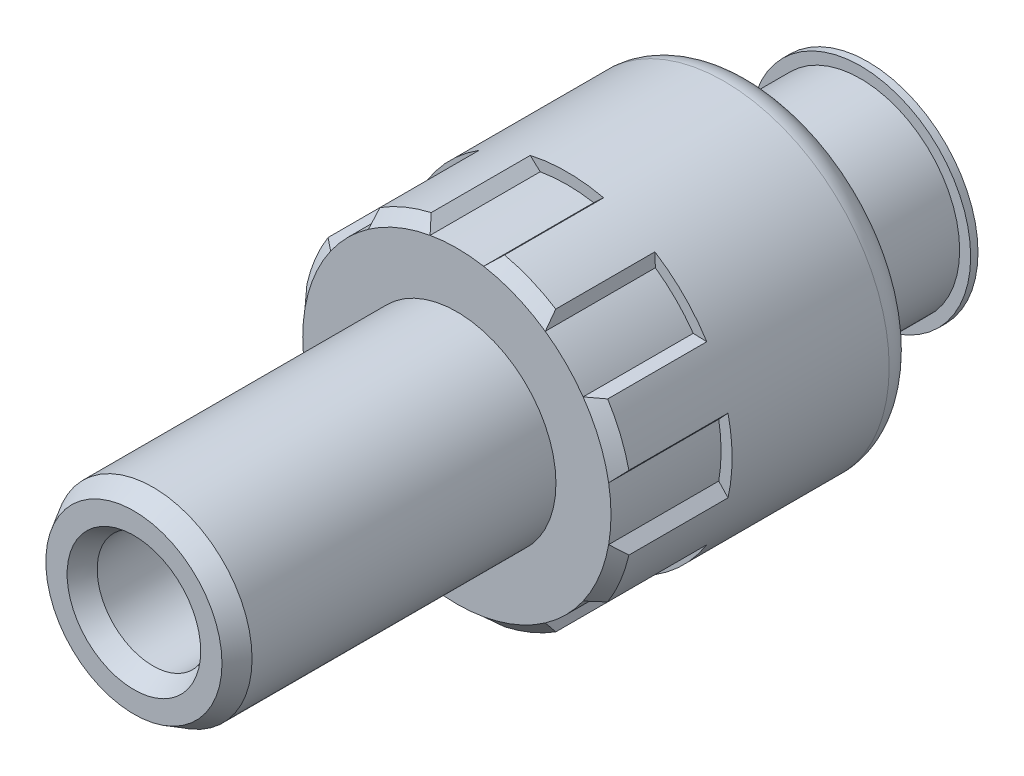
from build123d import *

# Parameters (mm, degrees)
FLUTES_START        = -3.81
FLUTES_DEPTH        = 3.81
SKETCH3_R           = 3.106695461
BOSS_EXTRUDE1_DEPTH = 7.62


with BuildPart() as part:
    # Sketch1 → body (revolve)
    with BuildSketch(Plane(origin=(0, 0, 0), x_dir=(0, 0, -1), z_dir=(1, 0, 0)), mode=Mode.PRIVATE) as body_sk:
        with BuildLine():
            Line((0, 2.3114), (0, 3.048))
            Line((0, 3.048), (0.659911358, 3.429))
            Line((0.659911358, 3.429), (11.176, 3.429))
            Line((11.176, 3.429), (11.176, 5.334))
            Line((11.176, 5.334), (11.557, 5.715))
            Line((11.557, 5.715), (20.4216, 5.715))
            ThreePointArc((20.4216, 5.715), (21.14002049, 5.41742049), (21.4376, 4.699))
            Line((21.4376, 4.699), (21.4376, 3.81))
            Line((21.4376, 3.81), (21.4376, 3.429))
            Line((21.4376, 3.429), (25.146, 3.429))
            Line((25.146, 3.429), (25.146, 3.81))
            Line((25.146, 3.81), (25.4, 3.81))
            Line((25.4, 3.81), (25.4, 3.175))
            Line((25.4, 3.175), (17.4752, 3.175))
            Line((17.4752, 3.175), (17.4752, 1.9304))
            Line((17.4752, 1.9304), (0.659911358, 1.9304))
            Line((0.659911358, 1.9304), (0, 2.3114))
        make_face()
    revolve(body_sk.sketch.rotate(Axis((0, 0, 0), (0, 0, -1)), 90), axis=Axis((0, 0, 0), (0, 0, -1)))

    # Sketch2 → flutes (cut)
    with BuildSketch(Plane.XY.offset(-11.176).offset(FLUTES_START)):
        with BuildLine():
            Line((3.059456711, 4.369357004), (3.04204577, 4.838096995))
            ThreePointArc((3.04204577, 4.838096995), (4.041115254, 4.041115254), (4.838096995, 3.04204577))
            Line((4.838096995, 3.04204577), (4.369357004, 3.059456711))
            ThreePointArc((4.369357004, 3.059456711), (3.771707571, 3.771707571), (3.059456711, 4.369357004))
        make_face()
        with BuildLine():
            Line((-0.92623938, 5.252964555), (-1.27, 5.572102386))
            ThreePointArc((-1.27, 5.572102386), (0, 5.715), (1.27, 5.572102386))
            Line((1.27, 5.572102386), (0.92623938, 5.252964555))
            ThreePointArc((0.92623938, 5.252964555), (0, 5.334), (-0.92623938, 5.252964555))
        make_face()
        with BuildLine():
            Line((5.252964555, 0.92623938), (5.572102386, 1.27))
            ThreePointArc((5.572102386, 1.27), (5.715, 0), (5.572102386, -1.27))
            Line((5.572102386, -1.27), (5.252964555, -0.92623938))
            ThreePointArc((5.252964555, -0.92623938), (5.334, 0), (5.252964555, 0.92623938))
        make_face()
        with BuildLine():
            Line((4.369357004, -3.059456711), (4.838096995, -3.04204577))
            ThreePointArc((4.838096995, -3.04204577), (4.041115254, -4.041115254), (3.04204577, -4.838096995))
            Line((3.04204577, -4.838096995), (3.059456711, -4.369357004))
            ThreePointArc((3.059456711, -4.369357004), (3.771707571, -3.771707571), (4.369357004, -3.059456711))
        make_face()
        with BuildLine():
            Line((0.92623938, -5.252964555), (1.27, -5.572102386))
            ThreePointArc((1.27, -5.572102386), (0, -5.715), (-1.27, -5.572102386))
            Line((-1.27, -5.572102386), (-0.92623938, -5.252964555))
            ThreePointArc((-0.92623938, -5.252964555), (0, -5.334), (0.92623938, -5.252964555))
        make_face()
        with BuildLine():
            Line((-3.059456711, -4.369357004), (-3.04204577, -4.838096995))
            ThreePointArc((-3.04204577, -4.838096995), (-4.041115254, -4.041115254), (-4.838096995, -3.04204577))
            Line((-4.838096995, -3.04204577), (-4.369357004, -3.059456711))
            ThreePointArc((-4.369357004, -3.059456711), (-3.771707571, -3.771707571), (-3.059456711, -4.369357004))
        make_face()
        with BuildLine():
            Line((-5.252964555, -0.92623938), (-5.572102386, -1.27))
            ThreePointArc((-5.572102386, -1.27), (-5.715, 0), (-5.572102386, 1.27))
            Line((-5.572102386, 1.27), (-5.252964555, 0.92623938))
            ThreePointArc((-5.252964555, 0.92623938), (-5.334, 0), (-5.252964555, -0.92623938))
        make_face()
        with BuildLine():
            Line((-4.369357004, 3.059456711), (-4.838096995, 3.04204577))
            ThreePointArc((-4.838096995, 3.04204577), (-4.041115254, 4.041115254), (-3.04204577, 4.838096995))
            Line((-3.04204577, 4.838096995), (-3.059456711, 4.369357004))
            ThreePointArc((-3.059456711, 4.369357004), (-3.771707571, 3.771707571), (-4.369357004, 3.059456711))
        make_face()
    extrude(amount=FLUTES_DEPTH, mode=Mode.SUBTRACT)

    # Sketch3 → Boss-Extrude1 (add)
    with BuildSketch(Plane(origin=(0, 0, -17.4752), x_dir=(-1, 0, 0), z_dir=(0, 0, -1))):
        with Locations(Location((0, 0, 0), (0, 0, 180))):
            Circle(SKETCH3_R)
    extrude(amount=BOSS_EXTRUDE1_DEPTH)


solid = part.part
